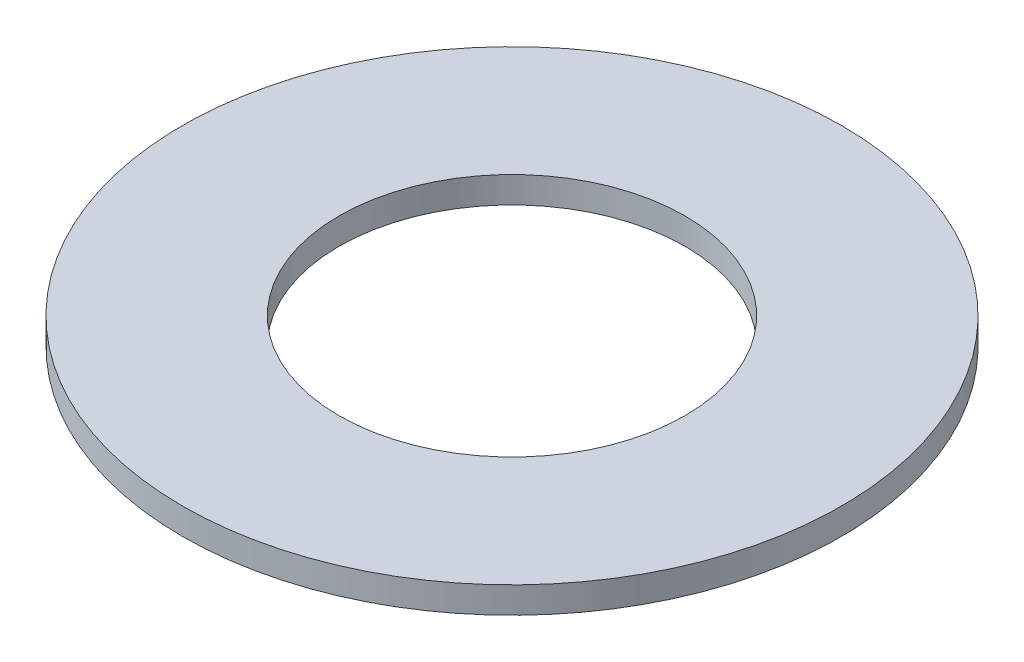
from build123d import *

# Parameters (mm, degrees)
SZKIC1_R                    = 10
SZKIC1_R_2                  = 5.25
DODANIE_WYCI_GNI_CIE1_DEPTH = 0.8


with BuildPart() as part:
    # Szkic1 → Dodanie-wyci_gni_cie1 (new body)
    with BuildSketch(Plane(origin=(0, 0, 0), x_dir=(1, 0, 0), z_dir=(0, 1, 0))):
        with Locations(Location((0, 0, 0), (0, 0, 270))):
            Circle(SZKIC1_R)
        with Locations(Location((0, 0, 0), (0, 0, 270))):
            Circle(SZKIC1_R_2, mode=Mode.SUBTRACT)
    extrude(amount=DODANIE_WYCI_GNI_CIE1_DEPTH)


solid = part.part
